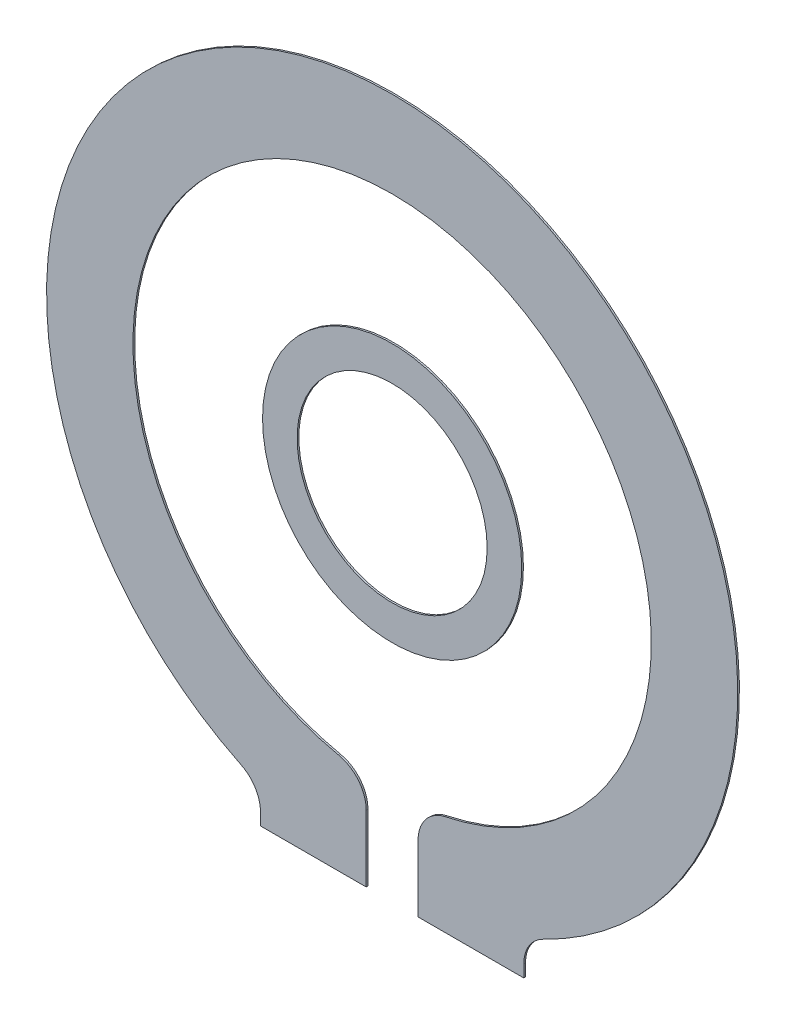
from build123d import *

# Parameters (mm, degrees)
SKETCH1_R             = 3.75
SKETCH1_R_2           = 2.75
BOSS_EXTRUDE1_DEPTH   = 0.05
BOSS_EXTRUDE1_2_DEPTH = 0.05


with BuildPart() as part:
    # Sketch1 → Boss-Extrude1 (new body)
    with BuildSketch(Plane.XY):
        Circle(SKETCH1_R)
        Circle(SKETCH1_R_2, mode=Mode.SUBTRACT)
    extrude(amount=BOSS_EXTRUDE1_DEPTH)


with BuildPart() as body_2:
    # Sketch1 → Boss-Extrude1 2 (new body)
    with BuildSketch(Plane.XY):
        with BuildLine():
            Line((3.81, -10.245750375), (0.75, -10.245750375))
            Line((0.75, -10.245750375), (0.75, -8.31790238))
            ThreePointArc((0.75, -8.31790238), (0.97350713, -7.687776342), (1.544117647, -7.339325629))
            ThreePointArc((1.544117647, -7.339325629), (0, 7.5), (-1.544117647, -7.339325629))
            ThreePointArc((-1.544117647, -7.339325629), (-0.97350713, -7.687776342), (-0.75, -8.31790238))
            Line((-0.75, -8.31790238), (-0.75, -10.245750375))
            Line((-0.75, -10.245750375), (-3.81, -10.245750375))
            Line((-3.81, -10.245750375), (-3.81, -9.89261846))
            ThreePointArc((-3.81, -9.89261846), (-3.962275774, -9.362181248), (-4.372727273, -8.993289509))
            ThreePointArc((-4.372727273, -8.993289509), (0, 10), (4.372727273, -8.993289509))
            ThreePointArc((4.372727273, -8.993289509), (3.962275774, -9.362181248), (3.81, -9.89261846))
            Line((3.81, -9.89261846), (3.81, -10.245750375))
        make_face()
    extrude(amount=BOSS_EXTRUDE1_2_DEPTH)


solid = Compound([part.part, body_2.part])
